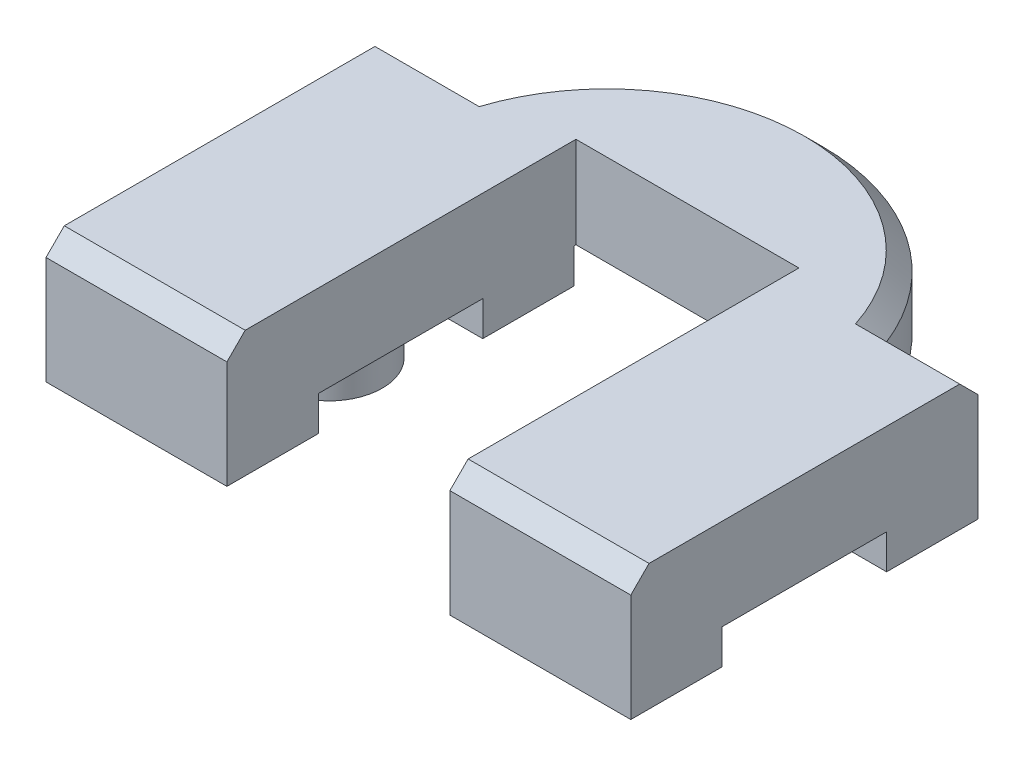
from build123d import *

# Parameters (mm, degrees)
BOSS_EXTRUDE1_DEPTH = 5
SKETCH4_W           = 9.9
SKETCH4_H           = 5
BOSS_EXTRUDE2_DEPTH = 1.9
SKETCH5_R           = 2.9
BOSS_EXTRUDE3_DEPTH = 2.5
CHAMFER1_SIZE       = 1


with BuildPart() as part:
    # Sketch3 → Boss-Extrude1 (new body)
    with BuildSketch(Plane(origin=(0, 0, 0), x_dir=(1, 0, 0), z_dir=(0, 1, 0))):
        with BuildLine():
            Line((-16, -9.5), (-6.1, -9.5))
            Line((-6.1, -9.5), (-6.1, 9.6))
            Line((-6.1, 9.6), (6.1, 9.6))
            Line((6.1, 9.6), (6.1, -9.5))
            Line((6.1, -9.5), (16, -9.5))
            Line((16, -9.5), (16, 9.5))
            Line((16, 9.5), (11, 9.5))
            ThreePointArc((11, 9.5), (0, 17), (-11, 9.5))
            Line((-11, 9.5), (-16, 9.5))
            Line((-16, 9.5), (-16, -9.5))
        make_face()
    extrude(amount=BOSS_EXTRUDE1_DEPTH)

    # Sketch4 → Boss-Extrude2 (add)
    with BuildSketch(Plane(origin=(0, 0, 0), x_dir=(1, 0, 0), z_dir=(0, 1, 0))):
        with Locations((-11.05, 7)):
            Rectangle(SKETCH4_W, SKETCH4_H)
        with Locations((-11.05, -7)):
            Rectangle(SKETCH4_W, SKETCH4_H)
        with Locations((11.05, 7)):
            Rectangle(SKETCH4_W, SKETCH4_H)
        with Locations((11.05, -7)):
            Rectangle(SKETCH4_W, SKETCH4_H)
    extrude(amount=-BOSS_EXTRUDE2_DEPTH)

    # Sketch5 → Boss-Extrude3 (add)
    with BuildSketch(Plane(origin=(0, 0, 0), x_dir=(1, 0, 0), z_dir=(0, 1, 0))):
        with Locations(Location((-10, 0, 0), (0, 0, 270))):
            Circle(SKETCH5_R)
        with Locations(Location((10, 0, 0), (0, 0, 270))):
            Circle(SKETCH5_R)
    extrude(amount=-BOSS_EXTRUDE3_DEPTH)

    # Chamfer1
    chamfer1_edges = [part.edges().sort_by_distance(p)[0] for p in [
        (0, 0, -17),
        (-11.05, 5, 9.5),
        (11.05, 5, 9.5),
        (13.5, 5, -9.5),
        (0, 5, -17),
        (-13.5, 5, -9.5),
    ]]
    chamfer(chamfer1_edges, length=CHAMFER1_SIZE)


solid = part.part
